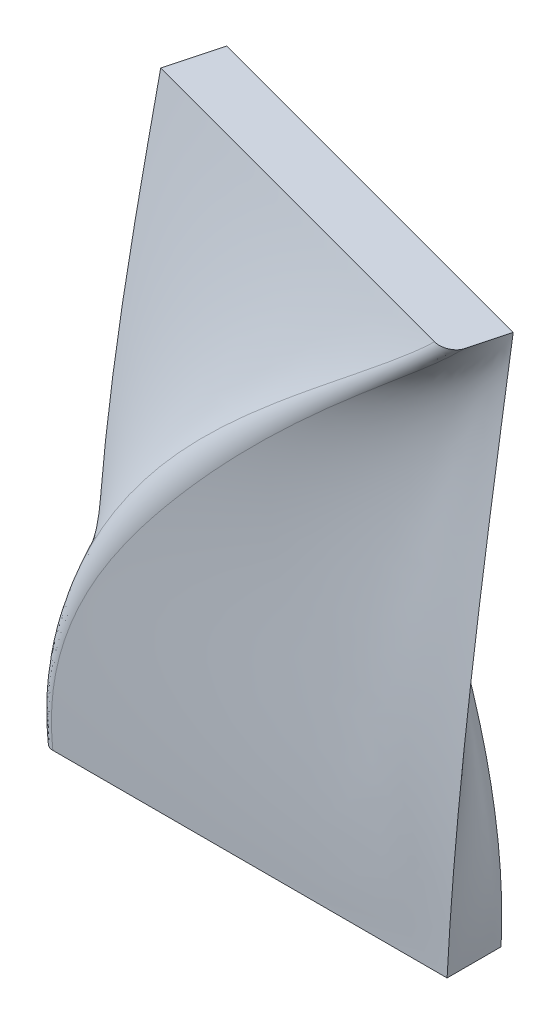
ISO-10303-21;
HEADER;
FILE_DESCRIPTION(('STEP AP214'),'2;1');
FILE_NAME('part.step','',(''),(''),'','','');
FILE_SCHEMA(('AUTOMOTIVE_DESIGN { 1 0 10303 214 1 1 1 1 }'));
ENDSEC;
DATA;
#1=APPLICATION_CONTEXT('core data for automotive mechanical design processes');
#2=APPLICATION_PROTOCOL_DEFINITION('international standard','automotive_design',2000,#1);
#3=PRODUCT_CONTEXT('',#1,'mechanical');
#4=PRODUCT('Part','Part','',(#3));
#5=PRODUCT_RELATED_PRODUCT_CATEGORY('part','',(#4));
#6=PRODUCT_DEFINITION_FORMATION('','',#4);
#7=PRODUCT_DEFINITION_CONTEXT('part definition',#1,'design');
#8=PRODUCT_DEFINITION('design','',#6,#7);
#9=PRODUCT_DEFINITION_SHAPE('','',#8);
#10=(LENGTH_UNIT() NAMED_UNIT(*) SI_UNIT(.MILLI.,.METRE.));
#11=(NAMED_UNIT(*) PLANE_ANGLE_UNIT() SI_UNIT($,.RADIAN.));
#12=(NAMED_UNIT(*) SI_UNIT($,.STERADIAN.) SOLID_ANGLE_UNIT());
#13=UNCERTAINTY_MEASURE_WITH_UNIT(LENGTH_MEASURE(1.E-05),#10,'distance_accuracy_value','');
#14=(GEOMETRIC_REPRESENTATION_CONTEXT(3) GLOBAL_UNCERTAINTY_ASSIGNED_CONTEXT((#13)) GLOBAL_UNIT_ASSIGNED_CONTEXT((#10,
#11,#12)) REPRESENTATION_CONTEXT('',''));
#15=CARTESIAN_POINT('',(0.,0.,0.));
#16=DIRECTION('',(0.,0.,1.));
#17=DIRECTION('',(1.,0.,0.));
#18=AXIS2_PLACEMENT_3D('',#15,#16,#17);
#19=CARTESIAN_POINT('',(75.,100.,0.));
#20=DIRECTION('',(0.,1.,0.));
#21=DIRECTION('',(0.,0.,1.));
#22=AXIS2_PLACEMENT_3D('',#19,#20,#21);
#23=PLANE('',#22);
#24=DIRECTION('',(0.96592582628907,0.,0.258819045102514));
#25=VECTOR('',#24,1.);
#26=CARTESIAN_POINT('',(75.,100.,0.));
#27=LINE('',#26,#25);
#28=CARTESIAN_POINT('',(2.55556302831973,100.,-19.4114283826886));
#29=VERTEX_POINT('',#28);
#30=CARTESIAN_POINT('',(71.818234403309,100.,-0.852551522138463));
#31=VERTEX_POINT('',#30);
#32=EDGE_CURVE('E155',#29,#31,#27,.T.);
#33=ORIENTED_EDGE('',*,*,#32,.T.);
#34=CARTESIAN_POINT('',(75.6619344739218,100.000051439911,-2.47620010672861));
#35=CARTESIAN_POINT('',(75.6575151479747,100.000051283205,-2.46031665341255));
#36=CARTESIAN_POINT('',(75.6528448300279,100.00003921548,-2.4445036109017));
#37=CARTESIAN_POINT('',(75.6429366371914,99.9999974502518,-2.4127598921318));
#38=CARTESIAN_POINT('',(75.6376904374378,99.9999674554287,-2.39683181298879));
#39=CARTESIAN_POINT('',(75.6266242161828,99.999895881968,-2.36487486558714));
#40=CARTESIAN_POINT('',(75.6207960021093,99.9998541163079,-2.34884883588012));
#41=CARTESIAN_POINT('',(75.608560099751,99.9997641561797,-2.31671396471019));
#42=CARTESIAN_POINT('',(75.6021443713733,99.9997158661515,-2.30060819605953));
#43=CARTESIAN_POINT('',(75.58185627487,99.999567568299,-2.25179959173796));
#44=CARTESIAN_POINT('',(75.5672221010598,99.9994664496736,-2.21941019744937));
#45=CARTESIAN_POINT('',(75.5356122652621,99.9992885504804,-2.15451241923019));
#46=CARTESIAN_POINT('',(75.5185766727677,99.9992126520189,-2.1220333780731));
#47=CARTESIAN_POINT('',(75.4821392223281,99.9991042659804,-2.05711250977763));
#48=CARTESIAN_POINT('',(75.4626807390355,99.9990731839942,-2.02470249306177));
#49=CARTESIAN_POINT('',(75.4213871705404,99.999062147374,-1.96008595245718));
#50=CARTESIAN_POINT('',(75.3994990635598,99.9990837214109,-1.92791337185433));
#51=CARTESIAN_POINT('',(75.3533491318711,99.9991731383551,-1.86394064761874));
#52=CARTESIAN_POINT('',(75.3290380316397,99.9992422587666,-1.83217610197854));
#53=CARTESIAN_POINT('',(75.278059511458,99.9994097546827,-1.76918918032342));
#54=CARTESIAN_POINT('',(75.251346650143,99.9995088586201,-1.73800362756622));
#55=CARTESIAN_POINT('',(75.1955959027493,99.9997036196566,-1.6763435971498));
#56=CARTESIAN_POINT('',(75.1665164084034,99.999799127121,-1.64590679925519));
#57=CARTESIAN_POINT('',(75.1060798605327,99.9999514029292,-1.58590266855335));
#58=CARTESIAN_POINT('',(75.0746850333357,100.000007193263,-1.55637337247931));
#59=CARTESIAN_POINT('',(75.0194763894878,99.9999948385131,-1.50710530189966));
#60=CARTESIAN_POINT('',(74.9960259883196,99.9999572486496,-1.48695702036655));
#61=CARTESIAN_POINT('',(74.9471383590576,99.9998405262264,-1.44645082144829));
#62=CARTESIAN_POINT('',(74.9216621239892,99.999759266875,-1.42613997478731));
#63=CARTESIAN_POINT('',(74.8686923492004,99.9995926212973,-1.38543759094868));
#64=CARTESIAN_POINT('',(74.8411619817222,99.9995072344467,-1.36509404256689));
#65=CARTESIAN_POINT('',(74.7840579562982,99.9993555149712,-1.32446690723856));
#66=CARTESIAN_POINT('',(74.7544494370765,99.9992902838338,-1.30423234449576));
#67=CARTESIAN_POINT('',(74.6931732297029,99.999196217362,-1.26397170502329));
#68=CARTESIAN_POINT('',(74.6614727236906,99.9991691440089,-1.24399560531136));
#69=CARTESIAN_POINT('',(74.5960066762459,99.9991588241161,-1.20440771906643));
#70=CARTESIAN_POINT('',(74.5622104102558,99.9991774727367,-1.18484676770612));
#71=CARTESIAN_POINT('',(74.4925584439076,99.9992555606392,-1.14625038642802));
#72=CARTESIAN_POINT('',(74.4566742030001,99.9993165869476,-1.12726649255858));
#73=CARTESIAN_POINT('',(74.3828641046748,99.9994654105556,-1.08998861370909));
#74=CARTESIAN_POINT('',(74.3449119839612,99.9995541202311,-1.07174665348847));
#75=CARTESIAN_POINT('',(74.2669971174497,99.9997296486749,-1.03611851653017));
#76=CARTESIAN_POINT('',(74.2270104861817,99.999816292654,-1.01878462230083));
#77=CARTESIAN_POINT('',(74.1450702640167,99.9999553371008,-0.985134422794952));
#78=CARTESIAN_POINT('',(74.1030952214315,100.000006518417,-0.968870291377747));
#79=CARTESIAN_POINT('',(74.0348717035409,99.9999959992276,-0.943963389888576));
#80=CARTESIAN_POINT('',(74.0088108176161,99.9999702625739,-0.934803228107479));
#81=CARTESIAN_POINT('',(73.9515396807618,99.9999120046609,-0.91542034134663));
#82=CARTESIAN_POINT('',(73.9202868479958,99.9998791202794,-0.905323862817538));
#83=CARTESIAN_POINT('',(73.8115051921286,99.9998227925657,-0.871805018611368));
#84=CARTESIAN_POINT('',(73.733294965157,99.9998838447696,-0.850542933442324));
#85=CARTESIAN_POINT('',(73.6078480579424,99.9999569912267,-0.820808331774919));
#86=CARTESIAN_POINT('',(73.5609982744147,99.9999788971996,-0.810657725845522));
#87=CARTESIAN_POINT('',(73.466337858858,100.000021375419,-0.792028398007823));
#88=CARTESIAN_POINT('',(73.4185226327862,100.00004192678,-0.783572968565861));
#89=CARTESIAN_POINT('',(73.2903431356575,100.000110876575,-0.763423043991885));
#90=CARTESIAN_POINT('',(73.2097138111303,100.00016870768,-0.753374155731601));
#91=CARTESIAN_POINT('',(73.0684048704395,100.000095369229,-0.740265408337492));
#92=CARTESIAN_POINT('',(73.0078258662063,100.000008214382,-0.73608174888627));
#93=CARTESIAN_POINT('',(72.9020371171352,99.9999938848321,-0.731277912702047));
#94=CARTESIAN_POINT('',(72.8568559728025,100.000031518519,-0.73002030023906));
#95=CARTESIAN_POINT('',(72.7681437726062,100.00012879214,-0.72911656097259));
#96=CARTESIAN_POINT('',(72.724613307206,100.000187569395,-0.729412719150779));
#97=CARTESIAN_POINT('',(72.6392303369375,100.000304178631,-0.731450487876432));
#98=CARTESIAN_POINT('',(72.5973765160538,100.000361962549,-0.733137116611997));
#99=CARTESIAN_POINT('',(72.5153632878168,100.000456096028,-0.737799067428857));
#100=CARTESIAN_POINT('',(72.4752009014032,100.000493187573,-0.740722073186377));
#101=CARTESIAN_POINT('',(72.3965766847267,100.000537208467,-0.747709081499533));
#102=CARTESIAN_POINT('',(72.3581104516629,100.000545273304,-0.751723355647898));
#103=CARTESIAN_POINT('',(72.282879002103,100.000532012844,-0.760755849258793));
#104=CARTESIAN_POINT('',(72.2461080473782,100.000511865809,-0.765726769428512));
#105=CARTESIAN_POINT('',(72.1405923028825,100.000412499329,-0.781610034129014));
#106=CARTESIAN_POINT('',(72.0720502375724,100.00029699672,-0.793912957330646));
#107=CARTESIAN_POINT('',(71.941642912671,100.000102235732,-0.821305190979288));
#108=CARTESIAN_POINT('',(71.8797083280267,100.00002072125,-0.836065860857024));
#109=CARTESIAN_POINT('',(71.8182344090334,100.,-0.852551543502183));
#110=B_SPLINE_CURVE_WITH_KNOTS('',3,(#34,#35,#36,#37,#38,#39,#40,#41,#42,#43,#44,#45,#46,#47,
#48,#49,#50,#51,#52,#53,#54,#55,#56,#57,#58,#59,#60,#61,#62,#63,#64,#65,#66,#67,#68,#69,#70,#71,
#72,#73,#74,#75,#76,#77,#78,#79,#80,#81,#82,#83,#84,#85,#86,#87,#88,#89,#90,#91,#92,#93,#94,#95,
#96,#97,#98,#99,#100,#101,#102,#103,#104,#105,#106,#107,#108,#109),.UNSPECIFIED.,.F.,.F.,(4,2,2,
2,2,2,2,2,2,2,2,2,2,2,2,2,2,2,2,2,2,2,2,2,2,2,2,2,2,2,2,2,2,2,2,2,2,4),(0.,0.0494575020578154,
0.0997589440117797,0.150909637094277,0.202912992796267,0.309470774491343,0.419437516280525,
0.532783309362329,0.64945860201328,0.769397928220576,0.892523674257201,1.0187498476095,
1.14798580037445,1.24071835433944,1.33844139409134,1.44111261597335,1.54867491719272,
1.66105735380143,1.77817612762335,1.89993566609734,2.02622983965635,2.15694334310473,
2.29195324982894,2.37481753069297,2.47333835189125,2.71627328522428,2.86005441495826,
3.00569299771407,3.2492709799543,3.43137732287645,3.56694575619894,3.6975149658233,
3.82315572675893,3.9439414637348,4.05994750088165,4.17125048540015,4.38003654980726,
4.5709514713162),.UNSPECIFIED.);
#111=CARTESIAN_POINT('',(75.6634721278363,100.,-2.47611169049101));
#112=VERTEX_POINT('',#111);
#113=EDGE_CURVE('E117',#31,#112,#110,.F.);
#114=ORIENTED_EDGE('',*,*,#113,.T.);
#115=DIRECTION('',(0.258819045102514,0.,-0.96592582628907));
#116=VECTOR('',#115,1.);
#117=CARTESIAN_POINT('',(75.,100.,0.));
#118=LINE('',#117,#116);
#119=CARTESIAN_POINT('',(77.5881904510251,100.,-9.65925826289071));
#120=VERTEX_POINT('',#119);
#121=EDGE_CURVE('E220',#112,#120,#118,.T.);
#122=ORIENTED_EDGE('',*,*,#121,.T.);
#123=DIRECTION('',(-0.96592582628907,0.,-0.258819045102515));
#124=VECTOR('',#123,1.);
#125=CARTESIAN_POINT('',(77.5881904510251,100.,-9.65925826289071));
#126=LINE('',#125,#124);
#127=CARTESIAN_POINT('',(5.14375347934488,100.,-29.0706866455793));
#128=VERTEX_POINT('',#127);
#129=EDGE_CURVE('E170',#120,#128,#126,.T.);
#130=ORIENTED_EDGE('',*,*,#129,.T.);
#131=DIRECTION('',(-0.258819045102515,0.,0.96592582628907));
#132=VECTOR('',#131,1.);
#133=CARTESIAN_POINT('',(2.55556302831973,100.,-19.4114283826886));
#134=LINE('',#133,#132);
#135=EDGE_CURVE('E145',#128,#29,#134,.T.);
#136=ORIENTED_EDGE('',*,*,#135,.T.);
#137=EDGE_LOOP('',(#33,#114,#122,#130,#136));
#138=FACE_BOUND('',#137,.T.);
#139=ADVANCED_FACE('F91',(#138),#23,.T.);
#140=CARTESIAN_POINT('',(0.,0.,-10.));
#141=DIRECTION('',(0.,-1.,0.));
#142=DIRECTION('',(0.,0.,-1.));
#143=AXIS2_PLACEMENT_3D('',#140,#141,#142);
#144=PLANE('',#143);
#145=DIRECTION('',(1.,0.,0.));
#146=VECTOR('',#145,1.);
#147=CARTESIAN_POINT('',(0.,0.,0.));
#148=LINE('',#147,#146);
#149=CARTESIAN_POINT('',(1.99710814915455,0.,0.));
#150=VERTEX_POINT('',#149);
#151=CARTESIAN_POINT('',(75.,0.,0.));
#152=VERTEX_POINT('',#151);
#153=EDGE_CURVE('E303',#150,#152,#148,.T.);
#154=ORIENTED_EDGE('',*,*,#153,.F.);
#155=CARTESIAN_POINT('',(-0.000113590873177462,-2.02841709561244E-08,-1.99691704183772));
#156=CARTESIAN_POINT('',(-0.000113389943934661,-2.15228824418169E-07,-1.96255467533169));
#157=CARTESIAN_POINT('',(0.000773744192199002,-1.23046115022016E-05,-1.92819238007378));
#158=CARTESIAN_POINT('',(0.00431919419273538,-5.2598160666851E-05,-1.8595011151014));
#159=CARTESIAN_POINT('',(0.0069804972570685,-8.0829494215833E-05,-1.82517229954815));
#160=CARTESIAN_POINT('',(0.0140711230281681,-0.000145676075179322,-1.75670208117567));
#161=CARTESIAN_POINT('',(0.0185002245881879,-0.000182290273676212,-1.72256065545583));
#162=CARTESIAN_POINT('',(0.0291043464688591,-0.000257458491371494,-1.65461841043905));
#163=CARTESIAN_POINT('',(0.0352759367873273,-0.000296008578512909,-1.62081705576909));
#164=CARTESIAN_POINT('',(0.0493258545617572,-0.000369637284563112,-1.55370481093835));
#165=CARTESIAN_POINT('',(0.0571976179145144,-0.0004047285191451,-1.52039254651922));
#166=CARTESIAN_POINT('',(0.0745918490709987,-0.000467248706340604,-1.45440255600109));
#167=CARTESIAN_POINT('',(0.0841047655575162,-0.000494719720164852,-1.42172231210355));
#168=CARTESIAN_POINT('',(0.10470959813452,-0.000539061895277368,-1.3571323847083));
#169=CARTESIAN_POINT('',(0.115789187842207,-0.000556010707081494,-1.32521876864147));
#170=CARTESIAN_POINT('',(0.139441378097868,-0.000577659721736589,-1.2622880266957));
#171=CARTESIAN_POINT('',(0.151999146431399,-0.000582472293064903,-1.23126532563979));
#172=CARTESIAN_POINT('',(0.178509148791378,-0.000579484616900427,-1.17023050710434));
#173=CARTESIAN_POINT('',(0.192444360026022,-0.000571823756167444,-1.14021099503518));
#174=CARTESIAN_POINT('',(0.221600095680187,-0.000544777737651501,-1.08128340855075));
#175=CARTESIAN_POINT('',(0.236801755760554,-0.000525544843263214,-1.05236599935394));
#176=CARTESIAN_POINT('',(0.268372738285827,-0.000477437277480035,-0.995729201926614));
#177=CARTESIAN_POINT('',(0.284721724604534,-0.000448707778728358,-0.967998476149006));
#178=CARTESIAN_POINT('',(0.318463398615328,-0.000384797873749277,-0.913806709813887));
#179=CARTESIAN_POINT('',(0.335834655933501,-0.000349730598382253,-0.887332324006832));
#180=CARTESIAN_POINT('',(0.371492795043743,-0.000277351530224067,-0.835709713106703));
#181=CARTESIAN_POINT('',(0.389757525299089,-0.000240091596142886,-0.810546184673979));
#182=CARTESIAN_POINT('',(0.42707254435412,-0.000168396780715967,-0.761586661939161));
#183=CARTESIAN_POINT('',(0.44610031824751,-0.000133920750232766,-0.73777350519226));
#184=CARTESIAN_POINT('',(0.484811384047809,-7.3726859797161E-05,-0.69154141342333));
#185=CARTESIAN_POINT('',(0.504472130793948,-4.78383414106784E-05,-0.66910359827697));
#186=CARTESIAN_POINT('',(0.544320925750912,-1.10231079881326E-05,-0.625634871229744));
#187=CARTESIAN_POINT('',(0.56448670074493,2.31571461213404E-07,-0.604583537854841));
#188=CARTESIAN_POINT('',(0.605524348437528,-2.29344670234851E-07,-0.563584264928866));
#189=CARTESIAN_POINT('',(0.62638756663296,-1.17250989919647E-05,-0.543627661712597));
#190=CARTESIAN_POINT('',(0.66948799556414,-5.02043929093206E-05,-0.50415729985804));
#191=CARTESIAN_POINT('',(0.691746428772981,-7.75640465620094E-05,-0.484666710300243));
#192=CARTESIAN_POINT('',(0.737631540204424,-0.000141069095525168,-0.44625736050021));
#193=CARTESIAN_POINT('',(0.761277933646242,-0.000177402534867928,-0.427362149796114));
#194=CARTESIAN_POINT('',(0.809919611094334,-0.000253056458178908,-0.390275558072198));
#195=CARTESIAN_POINT('',(0.834932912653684,-0.00029242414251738,-0.372107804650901));
#196=CARTESIAN_POINT('',(0.886274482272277,-0.000368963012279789,-0.336609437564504));
#197=CARTESIAN_POINT('',(0.912618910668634,-0.000406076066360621,-0.319302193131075));
#198=CARTESIAN_POINT('',(0.966573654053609,-0.000473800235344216,-0.285657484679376));
#199=CARTESIAN_POINT('',(0.994198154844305,-0.000504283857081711,-0.269342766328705));
#200=CARTESIAN_POINT('',(1.05064849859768,-0.00055542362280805,-0.237812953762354));
#201=CARTESIAN_POINT('',(1.07948648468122,-0.000575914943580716,-0.222619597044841));
#202=CARTESIAN_POINT('',(1.13828384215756,-0.000604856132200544,-0.19345731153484));
#203=CARTESIAN_POINT('',(1.1682533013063,-0.000613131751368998,-0.179508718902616));
#204=CARTESIAN_POINT('',(1.22921866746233,-0.000616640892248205,-0.152953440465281));
#205=CARTESIAN_POINT('',(1.26022265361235,-0.000611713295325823,-0.140365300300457));
#206=CARTESIAN_POINT('',(1.32314798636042,-0.000589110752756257,-0.116638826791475));
#207=CARTESIAN_POINT('',(1.35507551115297,-0.000571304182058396,-0.105516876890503));
#208=CARTESIAN_POINT('',(1.41972591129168,-0.000524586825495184,-0.0848189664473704));
#209=CARTESIAN_POINT('',(1.45245323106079,-0.000495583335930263,-0.0752568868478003));
#210=CARTESIAN_POINT('',(1.51856989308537,-0.000429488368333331,-0.0577612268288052));
#211=CARTESIAN_POINT('',(1.5519621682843,-0.000392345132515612,-0.0498387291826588));
#212=CARTESIAN_POINT('',(1.61926603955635,-0.000314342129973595,-0.035689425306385));
#213=CARTESIAN_POINT('',(1.65317932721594,-0.000273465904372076,-0.0294706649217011));
#214=CARTESIAN_POINT('',(1.7213753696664,-0.000193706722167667,-0.0187792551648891));
#215=CARTESIAN_POINT('',(1.7556588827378,-0.000154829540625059,-0.014311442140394));
#216=CARTESIAN_POINT('',(1.82444082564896,-8.59351831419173E-05,-0.00715507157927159));
#217=CARTESIAN_POINT('',(1.85893941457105,-5.59256332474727E-05,-0.00446804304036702));
#218=CARTESIAN_POINT('',(1.92799476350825,-1.30692217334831E-05,-0.000886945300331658));
#219=CARTESIAN_POINT('',(1.96255143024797,-2.05146081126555E-07,8.92267631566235E-06));
#220=CARTESIAN_POINT('',(1.9971081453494,-2.11112126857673E-10,8.12899409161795E-06));
#221=B_SPLINE_CURVE_WITH_KNOTS('',3,(#155,#156,#157,#158,#159,#160,#161,#162,#163,#164,#165,
#166,#167,#168,#169,#170,#171,#172,#173,#174,#175,#176,#177,#178,#179,#180,#181,#182,#183,#184,
#185,#186,#187,#188,#189,#190,#191,#192,#193,#194,#195,#196,#197,#198,#199,#200,#201,#202,#203,
#204,#205,#206,#207,#208,#209,#210,#211,#212,#213,#214,#215,#216,#217,#218,#219,#220),
.UNSPECIFIED.,.F.,.F.,(4,2,2,2,2,2,2,2,2,2,2,2,2,2,2,2,2,2,2,2,2,2,2,2,2,2,2,2,2,2,2,2,4),(0.,
0.103075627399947,0.206325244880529,0.309561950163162,0.412596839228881,0.515240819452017,
0.617306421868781,0.718609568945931,0.818971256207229,0.918219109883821,1.01618878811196,
1.11272519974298,1.20768352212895,1.3009300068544,1.39234256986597,1.4818111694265,
1.56923798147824,1.65582409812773,1.74455225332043,1.83532640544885,1.92803786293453,
2.02256538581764,2.11877549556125,2.21652300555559,2.31565177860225,2.41599571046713,
2.5173799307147,2.61962220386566,2.72253450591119,2.82592474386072,2.92959857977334,
3.03336131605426,3.13701979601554),.UNSPECIFIED.);
#222=CARTESIAN_POINT('',(0.,0.,-1.99691742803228));
#223=VERTEX_POINT('',#222);
#224=EDGE_CURVE('E13',#150,#223,#221,.F.);
#225=ORIENTED_EDGE('',*,*,#224,.T.);
#226=DIRECTION('',(0.,0.,1.));
#227=VECTOR('',#226,1.);
#228=CARTESIAN_POINT('',(0.,0.,0.));
#229=LINE('',#228,#227);
#230=CARTESIAN_POINT('',(0.,0.,-10.));
#231=VERTEX_POINT('',#230);
#232=EDGE_CURVE('E96',#231,#223,#229,.T.);
#233=ORIENTED_EDGE('',*,*,#232,.F.);
#234=DIRECTION('',(-1.,0.,0.));
#235=VECTOR('',#234,1.);
#236=CARTESIAN_POINT('',(0.,0.,-10.));
#237=LINE('',#236,#235);
#238=CARTESIAN_POINT('',(75.,0.,-10.));
#239=VERTEX_POINT('',#238);
#240=EDGE_CURVE('E149',#239,#231,#237,.T.);
#241=ORIENTED_EDGE('',*,*,#240,.F.);
#242=DIRECTION('',(0.,0.,-1.));
#243=VECTOR('',#242,1.);
#244=CARTESIAN_POINT('',(75.,0.,0.));
#245=LINE('',#244,#243);
#246=EDGE_CURVE('E293',#152,#239,#245,.T.);
#247=ORIENTED_EDGE('',*,*,#246,.F.);
#248=EDGE_LOOP('',(#154,#225,#233,#241,#247));
#249=FACE_BOUND('',#248,.T.);
#250=ADVANCED_FACE('F93',(#249),#144,.T.);
#251=CARTESIAN_POINT('',(75.,0.,0.));
#252=CARTESIAN_POINT('',(76.7532328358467,33.4536753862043,0.));
#253=CARTESIAN_POINT('',(77.1707116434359,66.7268376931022,-4.82962913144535));
#254=CARTESIAN_POINT('',(77.5881904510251,100.,-9.65925826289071));
#255=CARTESIAN_POINT('',(75.,0.,-0.833333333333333));
#256=CARTESIAN_POINT('',(76.7598825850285,33.5338041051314,-0.830882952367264));
#257=CARTESIAN_POINT('',(74.1555183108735,66.7669020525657,-6.05388012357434));
#258=CARTESIAN_POINT('',(71.5511540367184,100.,-11.2768772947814));
#259=CARTESIAN_POINT('',(75.,0.,-2.5));
#260=CARTESIAN_POINT('',(76.7731820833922,33.6940615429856,-2.49264885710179));
#261=CARTESIAN_POINT('',(68.1251316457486,66.8470307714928,-8.50238210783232));
#262=CARTESIAN_POINT('',(59.4770812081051,100.,-14.5121153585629));
#263=CARTESIAN_POINT('',(75.,0.,-4.58333333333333));
#264=CARTESIAN_POINT('',(76.8129886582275,35.0380669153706,-4.60661195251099));
#265=CARTESIAN_POINT('',(60.5987394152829,67.5190334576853,-11.5813874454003));
#266=CARTESIAN_POINT('',(44.3844901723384,100.,-18.5561629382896));
#267=CARTESIAN_POINT('',(75.,0.,-6.25));
#268=CARTESIAN_POINT('',(76.9546207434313,36.5249106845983,-6.20956871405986));
#269=CARTESIAN_POINT('',(54.6325190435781,68.2624553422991,-14.0004848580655));
#270=CARTESIAN_POINT('',(32.310417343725,100.,-21.7914010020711));
#271=CARTESIAN_POINT('',(75.,0.,-7.5));
#272=CARTESIAN_POINT('',(76.829859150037,37.8614239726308,-7.65437400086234));
#273=CARTESIAN_POINT('',(50.042360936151,68.9307119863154,-15.9361017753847));
#274=CARTESIAN_POINT('',(23.2548627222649,100.,-24.2178295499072));
#275=CARTESIAN_POINT('',(75.,0.,-8.75));
#276=CARTESIAN_POINT('',(77.6406435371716,39.3754295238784,-8.17293528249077));
#277=CARTESIAN_POINT('',(45.9199758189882,69.6877147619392,-17.408596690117));
#278=CARTESIAN_POINT('',(14.1993081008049,100.,-26.6442580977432));
#279=CARTESIAN_POINT('',(75.,0.,-9.58333333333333));
#280=CARTESIAN_POINT('',(75.8802145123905,40.5241909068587,-10.8269016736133));
#281=CARTESIAN_POINT('',(42.0212430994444,70.2620954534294,-19.5443894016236));
#282=CARTESIAN_POINT('',(8.16227168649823,100.,-28.2618771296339));
#283=CARTESIAN_POINT('',(75.,0.,-10.));
#284=CARTESIAN_POINT('',(75.,41.0985715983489,-12.1538848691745));
#285=CARTESIAN_POINT('',(40.0718767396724,70.5492857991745,-20.6122857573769));
#286=CARTESIAN_POINT('',(5.14375347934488,100.,-29.0706866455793));
#287=B_SPLINE_SURFACE_WITH_KNOTS('',3,3,((#251,#252,#253,#254),(#255,#256,#257,#258),(#259,#260,
#261,#262),(#263,#264,#265,#266),(#267,#268,#269,#270),(#271,#272,#273,#274),(#275,#276,#277,
#278),(#279,#280,#281,#282),(#283,#284,#285,#286)),.UNSPECIFIED.,.F.,.F.,.F.,(4,1,1,1,1,1,4),(4,
4),(0.,0.25,0.5,0.625,0.75,0.875,1.),(0.,1.),.UNSPECIFIED.);
#288=CARTESIAN_POINT('',(75.,0.,-10.));
#289=CARTESIAN_POINT('',(75.,41.0985715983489,-12.1538848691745));
#290=CARTESIAN_POINT('',(40.0718767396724,70.5492857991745,-20.6122857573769));
#291=CARTESIAN_POINT('',(5.14375347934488,100.,-29.0706866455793));
#292=B_SPLINE_CURVE_WITH_KNOTS('',3,(#288,#289,#290,#291),.UNSPECIFIED.,.F.,.F.,(4,4),(0.,1.),.UNSPECIFIED.);
#293=EDGE_CURVE('E334',#239,#128,#292,.T.);
#294=CARTESIAN_POINT('',(75.,0.,0.));
#295=CARTESIAN_POINT('',(76.7532328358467,33.4536753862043,0.));
#296=CARTESIAN_POINT('',(77.1707116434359,66.7268376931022,-4.82962913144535));
#297=CARTESIAN_POINT('',(77.5881904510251,100.,-9.65925826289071));
#298=B_SPLINE_CURVE_WITH_KNOTS('',3,(#294,#295,#296,#297),.UNSPECIFIED.,.F.,.F.,(4,4),(0.,1.),.UNSPECIFIED.);
#299=EDGE_CURVE('E154',#120,#152,#298,.F.);
#300=ORIENTED_EDGE('',*,*,#246,.T.);
#301=ORIENTED_EDGE('',*,*,#293,.T.);
#302=ORIENTED_EDGE('',*,*,#129,.F.);
#303=ORIENTED_EDGE('',*,*,#299,.T.);
#304=EDGE_LOOP('',(#300,#301,#302,#303));
#305=FACE_BOUND('',#304,.T.);
#306=ADVANCED_FACE('F333',(#305),#287,.T.);
#307=CARTESIAN_POINT('',(75.,0.,-10.));
#308=CARTESIAN_POINT('',(75.,41.0985715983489,-12.1538848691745));
#309=CARTESIAN_POINT('',(40.0718767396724,70.5492857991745,-20.6122857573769));
#310=CARTESIAN_POINT('',(5.14375347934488,100.,-29.0706866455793));
#311=CARTESIAN_POINT('',(68.75,0.,-10.));
#312=CARTESIAN_POINT('',(68.7519940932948,39.9775012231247,-12.0971261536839));
#313=CARTESIAN_POINT('',(36.8400325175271,69.9887506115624,-20.1814373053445));
#314=CARTESIAN_POINT('',(4.92807094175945,100.,-28.2657484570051));
#315=CARTESIAN_POINT('',(56.25,0.,-10.));
#316=CARTESIAN_POINT('',(56.2559822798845,37.7353604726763,-11.9836087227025));
#317=CARTESIAN_POINT('',(30.3763440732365,68.8676802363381,-19.3197404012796));
#318=CARTESIAN_POINT('',(4.49670586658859,100.,-26.6558720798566));
#319=CARTESIAN_POINT('',(40.625,0.,-10.));
#320=CARTESIAN_POINT('',(40.6060561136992,35.7019669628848,-11.8521169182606));
#321=CARTESIAN_POINT('',(22.2817778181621,67.8509834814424,-18.2478217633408));
#322=CARTESIAN_POINT('',(3.95749952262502,100.,-24.6435266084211));
#323=CARTESIAN_POINT('',(28.125,0.,-10.));
#324=CARTESIAN_POINT('',(28.1579025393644,34.5101550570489,-11.8415031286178));
#325=CARTESIAN_POINT('',(15.8420184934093,67.2550775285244,-17.4375766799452));
#326=CARTESIAN_POINT('',(3.52613444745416,100.,-23.0336502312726));
#327=CARTESIAN_POINT('',(18.75,0.,-10.));
#328=CARTESIAN_POINT('',(18.6243721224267,33.8760544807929,-11.6497409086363));
#329=CARTESIAN_POINT('',(10.9134913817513,66.9380272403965,-16.7379919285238));
#330=CARTESIAN_POINT('',(3.20261064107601,100.,-21.8262429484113));
#331=CARTESIAN_POINT('',(9.375,0.,-10.));
#332=CARTESIAN_POINT('',(9.84460897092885,33.4864441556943,-12.2245591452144));
#333=CARTESIAN_POINT('',(6.36184790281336,66.7432220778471,-16.4216974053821));
#334=CARTESIAN_POINT('',(2.87908683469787,100.,-20.6188356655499));
#335=CARTESIAN_POINT('',(3.125,0.,-10.));
#336=CARTESIAN_POINT('',(2.11299765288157,33.4591941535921,-10.7415197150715));
#337=CARTESIAN_POINT('',(2.38820097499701,66.7295970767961,-15.2777085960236));
#338=CARTESIAN_POINT('',(2.66340429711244,100.,-19.8138974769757));
#339=CARTESIAN_POINT('',(0.,0.,-10.));
#340=CARTESIAN_POINT('',(-1.75280800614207,33.445569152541,-10.));
#341=CARTESIAN_POINT('',(0.40137751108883,66.7227845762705,-14.7057141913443));
#342=CARTESIAN_POINT('',(2.55556302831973,100.,-19.4114283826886));
#343=B_SPLINE_SURFACE_WITH_KNOTS('',3,3,((#307,#308,#309,#310),(#311,#312,#313,#314),(#315,#316,
#317,#318),(#319,#320,#321,#322),(#323,#324,#325,#326),(#327,#328,#329,#330),(#331,#332,#333,
#334),(#335,#336,#337,#338),(#339,#340,#341,#342)),.UNSPECIFIED.,.F.,.F.,.F.,(4,1,1,1,1,1,4),(4,
4),(0.,0.25,0.5,0.625,0.75,0.875,1.),(0.,1.),.UNSPECIFIED.);
#344=CARTESIAN_POINT('',(0.,0.,-10.));
#345=CARTESIAN_POINT('',(-1.75280800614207,33.445569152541,-10.));
#346=CARTESIAN_POINT('',(0.40137751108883,66.7227845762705,-14.7057141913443));
#347=CARTESIAN_POINT('',(2.55556302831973,100.,-19.4114283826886));
#348=B_SPLINE_CURVE_WITH_KNOTS('',3,(#344,#345,#346,#347),.UNSPECIFIED.,.F.,.F.,(4,4),(0.,1.),.UNSPECIFIED.);
#349=EDGE_CURVE('E140',#231,#29,#348,.T.);
#350=ORIENTED_EDGE('',*,*,#240,.T.);
#351=ORIENTED_EDGE('',*,*,#349,.T.);
#352=ORIENTED_EDGE('',*,*,#135,.F.);
#353=ORIENTED_EDGE('',*,*,#293,.F.);
#354=EDGE_LOOP('',(#350,#351,#352,#353));
#355=FACE_BOUND('',#354,.T.);
#356=ADVANCED_FACE('F142',(#355),#343,.T.);
#357=CARTESIAN_POINT('',(0.,0.,0.));
#358=CARTESIAN_POINT('',(0.,41.6095639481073,2.180664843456));
#359=CARTESIAN_POINT('',(37.5,70.8047819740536,1.090332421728));
#360=CARTESIAN_POINT('',(75.,100.,0.));
#361=CARTESIAN_POINT('',(6.25,0.,0.));
#362=CARTESIAN_POINT('',(6.24800542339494,40.4591176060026,2.12236708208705));
#363=CARTESIAN_POINT('',(40.7318439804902,70.2295588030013,0.658714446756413));
#364=CARTESIAN_POINT('',(75.2156825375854,100.,-0.804938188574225));
#365=CARTESIAN_POINT('',(18.75,0.,0.));
#366=CARTESIAN_POINT('',(18.7440162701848,38.1582249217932,2.00577155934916));
#367=CARTESIAN_POINT('',(47.1955319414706,69.0791124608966,-0.204521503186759));
#368=CARTESIAN_POINT('',(75.6470476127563,100.,-2.41481456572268));
#369=CARTESIAN_POINT('',(34.375,0.,0.));
#370=CARTESIAN_POINT('',(34.393948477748,36.0259522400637,1.86909167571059));
#371=CARTESIAN_POINT('',(55.2901012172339,68.0129761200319,-1.27903418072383));
#372=CARTESIAN_POINT('',(76.1862539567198,100.,-4.42716003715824));
#373=CARTESIAN_POINT('',(46.875,0.,0.));
#374=CARTESIAN_POINT('',(46.8420894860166,34.7444487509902,1.8537899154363));
#375=CARTESIAN_POINT('',(61.7298542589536,67.3722243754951,-2.09162324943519));
#376=CARTESIAN_POINT('',(76.6176190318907,100.,-6.03703641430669));
#377=CARTESIAN_POINT('',(56.25,0.,0.));
#378=CARTESIAN_POINT('',(56.3756583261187,34.0380296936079,1.6581992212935));
#379=CARTESIAN_POINT('',(66.6584005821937,67.019014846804,-2.79312223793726));
#380=CARTESIAN_POINT('',(76.9411428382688,100.,-7.24444369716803));
#381=CARTESIAN_POINT('',(65.625,0.,0.));
#382=CARTESIAN_POINT('',(65.1552772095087,33.5724856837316,2.22918221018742));
#383=CARTESIAN_POINT('',(71.2099719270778,66.7862428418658,-3.11133438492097));
#384=CARTESIAN_POINT('',(77.264666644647,100.,-8.45185098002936));
#385=CARTESIAN_POINT('',(71.875,0.,0.));
#386=CARTESIAN_POINT('',(72.8872476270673,33.4932788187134,0.743060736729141));
#387=CARTESIAN_POINT('',(75.1837984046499,66.7466394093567,-4.25686421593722));
#388=CARTESIAN_POINT('',(77.4803491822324,100.,-9.25678916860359));
#389=CARTESIAN_POINT('',(75.,0.,0.));
#390=CARTESIAN_POINT('',(76.7532328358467,33.4536753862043,0.));
#391=CARTESIAN_POINT('',(77.1707116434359,66.7268376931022,-4.82962913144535));
#392=CARTESIAN_POINT('',(77.5881904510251,100.,-9.6592582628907));
#393=B_SPLINE_SURFACE_WITH_KNOTS('',3,3,((#357,#358,#359,#360),(#361,#362,#363,#364),(#365,#366,
#367,#368),(#369,#370,#371,#372),(#373,#374,#375,#376),(#377,#378,#379,#380),(#381,#382,#383,
#384),(#385,#386,#387,#388),(#389,#390,#391,#392)),.UNSPECIFIED.,.F.,.F.,.F.,(4,1,1,1,1,1,4),(4,
4),(0.,0.25,0.5,0.625,0.75,0.875,1.),(0.,1.),.UNSPECIFIED.);
#394=CARTESIAN_POINT('',(75.663355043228,99.9998596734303,-2.47614304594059));
#395=CARTESIAN_POINT('',(75.3420410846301,99.6701926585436,-2.3771168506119));
#396=CARTESIAN_POINT('',(75.0150490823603,99.344912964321,-2.28218992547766));
#397=CARTESIAN_POINT('',(74.3667360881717,98.7164301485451,-2.10483680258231));
#398=CARTESIAN_POINT('',(74.0458374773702,98.4128970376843,-2.02203779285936));
#399=CARTESIAN_POINT('',(73.4892922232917,97.8968923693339,-1.88663311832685));
#400=CARTESIAN_POINT('',(73.255349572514,97.6830688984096,-1.83213653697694));
#401=CARTESIAN_POINT('',(72.7949611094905,97.2670408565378,-1.7297214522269));
#402=CARTESIAN_POINT('',(72.5686422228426,97.0647411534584,-1.68161849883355));
#403=CARTESIAN_POINT('',(71.950451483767,96.5170299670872,-1.55584684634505));
#404=CARTESIAN_POINT('',(71.5564425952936,96.1732074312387,-1.4817623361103));
#405=CARTESIAN_POINT('',(70.7516924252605,95.4790213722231,-1.34030496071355));
#406=CARTESIAN_POINT('',(70.3408049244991,95.1287733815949,-1.27320195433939));
#407=CARTESIAN_POINT('',(69.5900721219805,94.4936967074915,-1.15875928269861));
#408=CARTESIAN_POINT('',(69.2507789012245,94.2084618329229,-1.11003789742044));
#409=CARTESIAN_POINT('',(68.6260404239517,93.6852368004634,-1.02523372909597));
#410=CARTESIAN_POINT('',(68.3408137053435,93.4471089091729,-0.988384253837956));
#411=CARTESIAN_POINT('',(67.442585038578,92.6988036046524,-0.877362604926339));
#412=CARTESIAN_POINT('',(66.8282749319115,92.1893673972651,-0.808774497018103));
#413=CARTESIAN_POINT('',(65.5438992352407,91.1254971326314,-0.676600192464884));
#414=CARTESIAN_POINT('',(64.8737212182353,90.5710797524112,-0.613997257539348));
#415=CARTESIAN_POINT('',(63.4810365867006,89.4165482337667,-0.49385107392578));
#416=CARTESIAN_POINT('',(62.7585832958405,88.8162878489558,-0.43709955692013));
#417=CARTESIAN_POINT('',(61.4607881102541,87.7322876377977,-0.342653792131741));
#418=CARTESIAN_POINT('',(60.884947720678,87.2492764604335,-0.303418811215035));
#419=CARTESIAN_POINT('',(59.6804066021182,86.234345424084,-0.225452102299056));
#420=CARTESIAN_POINT('',(59.0519058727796,85.7021572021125,-0.187125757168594));
#421=CARTESIAN_POINT('',(57.7440722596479,84.5883350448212,-0.111121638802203));
#422=CARTESIAN_POINT('',(57.0649994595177,84.0063725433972,-0.0737809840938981));
#423=CARTESIAN_POINT('',(56.0297566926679,83.1127220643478,-0.0193650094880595));
#424=CARTESIAN_POINT('',(55.6721165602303,82.8028123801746,-0.00102703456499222));
#425=CARTESIAN_POINT('',(55.0418116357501,82.2543838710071,0.0305706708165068));
#426=CARTESIAN_POINT('',(54.768890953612,82.0161695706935,0.0440126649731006));
#427=CARTESIAN_POINT('',(53.9112612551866,81.2652793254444,0.0856001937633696));
#428=CARTESIAN_POINT('',(53.3278505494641,80.7510738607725,0.112933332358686));
#429=CARTESIAN_POINT('',(52.1121483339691,79.6722096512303,0.168311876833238));
#430=CARTESIAN_POINT('',(51.4801831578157,79.1071751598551,0.196199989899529));
#431=CARTESIAN_POINT('',(50.1695376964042,77.9260467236,0.252513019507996));
#432=CARTESIAN_POINT('',(49.4912303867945,77.3095318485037,0.280797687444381));
#433=CARTESIAN_POINT('',(48.3054456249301,76.2217255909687,0.328964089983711));
#434=CARTESIAN_POINT('',(47.7967474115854,75.7517803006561,0.349209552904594));
#435=CARTESIAN_POINT('',(46.7094812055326,74.7404325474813,0.391747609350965));
#436=CARTESIAN_POINT('',(46.1314087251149,74.1984920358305,0.413914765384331));
#437=CARTESIAN_POINT('',(44.9080008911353,73.0423750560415,0.459996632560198));
#438=CARTESIAN_POINT('',(44.2632342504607,72.4275912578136,0.483786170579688));
#439=CARTESIAN_POINT('',(43.2742424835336,71.4755490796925,0.519553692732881));
#440=CARTESIAN_POINT('',(42.9279407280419,71.1404611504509,0.531940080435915));
#441=CARTESIAN_POINT('',(42.2935634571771,70.5234867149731,0.554395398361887));
#442=CARTESIAN_POINT('',(42.005231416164,70.2418656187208,0.564511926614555));
#443=CARTESIAN_POINT('',(41.1439300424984,69.3970552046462,0.594476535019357));
#444=CARTESIAN_POINT('',(40.5727232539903,68.8320552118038,0.61400913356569));
#445=CARTESIAN_POINT('',(39.4380896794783,67.6995079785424,0.652097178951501));
#446=CARTESIAN_POINT('',(38.874639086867,67.131984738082,0.670656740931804));
#447=CARTESIAN_POINT('',(37.7561949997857,65.9940639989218,0.706734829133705));
#448=CARTESIAN_POINT('',(37.2011736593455,65.4236940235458,0.724257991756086));
#449=CARTESIAN_POINT('',(36.0556560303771,64.2352469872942,0.759695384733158));
#450=CARTESIAN_POINT('',(35.4655773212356,63.6167656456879,0.777542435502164));
#451=CARTESIAN_POINT('',(34.3105005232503,62.3947007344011,0.811706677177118));
#452=CARTESIAN_POINT('',(33.7453151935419,61.7912949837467,0.828054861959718));
#453=CARTESIAN_POINT('',(32.6396684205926,60.5993279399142,0.85921950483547));
#454=CARTESIAN_POINT('',(32.0990133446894,60.0109471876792,0.874068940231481));
#455=CARTESIAN_POINT('',(31.0417638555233,58.8492464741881,0.902284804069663));
#456=CARTESIAN_POINT('',(30.5249793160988,58.2761003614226,0.915684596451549));
#457=CARTESIAN_POINT('',(29.5148445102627,57.1450279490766,0.941045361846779));
#458=CARTESIAN_POINT('',(29.021306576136,56.5872700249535,0.953040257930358));
#459=CARTESIAN_POINT('',(28.0569632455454,55.4871837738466,0.975646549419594));
#460=CARTESIAN_POINT('',(27.5859755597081,54.9450159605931,0.986292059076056));
#461=CARTESIAN_POINT('',(26.6661018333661,53.8762465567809,1.0062522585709));
#462=CARTESIAN_POINT('',(26.2170368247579,53.3497996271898,1.01560135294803));
#463=CARTESIAN_POINT('',(25.3823627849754,52.3629558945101,1.03221037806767));
#464=CARTESIAN_POINT('',(24.9962085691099,51.9030218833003,1.03958313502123));
#465=CARTESIAN_POINT('',(24.1986214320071,50.9455085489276,1.05411519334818));
#466=CARTESIAN_POINT('',(23.7874675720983,50.4476956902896,1.0612168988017));
#467=CARTESIAN_POINT('',(22.9416882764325,49.4137297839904,1.07494907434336));
#468=CARTESIAN_POINT('',(22.5073995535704,48.8773002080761,1.0815132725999));
#469=CARTESIAN_POINT('',(21.6173289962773,47.7653692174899,1.09389083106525));
#470=CARTESIAN_POINT('',(21.1619381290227,47.1895537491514,1.09962982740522));
#471=CARTESIAN_POINT('',(20.2319267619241,45.9980016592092,1.11004724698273));
#472=CARTESIAN_POINT('',(19.7577558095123,45.3819131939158,1.11464317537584));
#473=CARTESIAN_POINT('',(18.7927797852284,44.1088159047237,1.1224333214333));
#474=CARTESIAN_POINT('',(18.3024889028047,43.4514161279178,1.12553682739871));
#475=CARTESIAN_POINT('',(17.5659492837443,42.4465499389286,1.1288256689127));
#476=CARTESIAN_POINT('',(17.3156917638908,42.1020190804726,1.12969663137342));
#477=CARTESIAN_POINT('',(16.8123647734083,41.4021414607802,1.130926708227));
#478=CARTESIAN_POINT('',(16.5593763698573,41.0467363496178,1.13127277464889));
#479=CARTESIAN_POINT('',(16.1660043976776,40.4894604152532,1.13139837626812));
#480=CARTESIAN_POINT('',(16.0246575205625,40.2882681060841,1.13135923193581));
#481=CARTESIAN_POINT('',(15.5307442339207,39.5806973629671,1.13089764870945));
#482=CARTESIAN_POINT('',(15.1814044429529,39.0720625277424,1.12998583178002));
#483=CARTESIAN_POINT('',(14.2853357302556,37.7452676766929,1.12607739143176));
#484=CARTESIAN_POINT('',(13.7447744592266,36.9229272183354,1.12216339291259));
#485=CARTESIAN_POINT('',(12.8775213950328,35.564385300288,1.11317561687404));
#486=CARTESIAN_POINT('',(12.544249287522,35.0323697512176,1.1090346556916));
#487=CARTESIAN_POINT('',(12.006230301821,34.1559097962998,1.10117093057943));
#488=CARTESIAN_POINT('',(11.7986006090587,33.8132295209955,1.09783874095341));
#489=CARTESIAN_POINT('',(11.2096736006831,32.8275212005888,1.08750117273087));
#490=CARTESIAN_POINT('',(10.8336572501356,32.1813303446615,1.07981340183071));
#491=CARTESIAN_POINT('',(10.1324151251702,30.9415764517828,1.06329427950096));
#492=CARTESIAN_POINT('',(9.8057514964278,30.3488241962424,1.05464015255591));
#493=CARTESIAN_POINT('',(9.19956500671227,29.2173691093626,1.03665979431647));
#494=CARTESIAN_POINT('',(8.91865752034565,28.6794055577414,1.02749524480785));
#495=CARTESIAN_POINT('',(8.27817942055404,27.41816055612,1.00455068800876));
#496=CARTESIAN_POINT('',(7.9233444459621,26.6924733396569,0.990246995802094));
#497=CARTESIAN_POINT('',(7.25456619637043,25.2671712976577,0.959973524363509));
#498=CARTESIAN_POINT('',(6.93946192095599,24.568098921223,0.944124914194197));
#499=CARTESIAN_POINT('',(6.34794753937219,23.1969409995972,0.911067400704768));
#500=CARTESIAN_POINT('',(6.07037583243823,22.5253545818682,0.893972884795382));
#501=CARTESIAN_POINT('',(5.55166271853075,21.2101164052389,0.858720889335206));
#502=CARTESIAN_POINT('',(5.30936279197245,20.5669192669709,0.840670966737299));
#503=CARTESIAN_POINT('',(4.85890055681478,19.3094090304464,0.803795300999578));
#504=CARTESIAN_POINT('',(4.64958458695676,18.6955067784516,0.7850703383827));
#505=CARTESIAN_POINT('',(4.26277235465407,17.497532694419,0.747120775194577));
#506=CARTESIAN_POINT('',(4.0841288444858,16.9138290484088,0.727990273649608));
#507=CARTESIAN_POINT('',(3.75641006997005,15.7771844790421,0.689493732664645));
#508=CARTESIAN_POINT('',(3.60618994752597,15.2245707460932,0.670215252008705));
#509=CARTESIAN_POINT('',(3.28699470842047,13.9705641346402,0.625196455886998));
#510=CARTESIAN_POINT('',(3.12329250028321,13.267832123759,0.599078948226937));
#511=CARTESIAN_POINT('',(2.82979922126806,11.8758695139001,0.545597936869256));
#512=CARTESIAN_POINT('',(2.6991894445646,11.1868092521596,0.518289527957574));
#513=CARTESIAN_POINT('',(2.47057044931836,9.82283324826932,0.462596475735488));
#514=CARTESIAN_POINT('',(2.37176275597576,9.14805031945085,0.434262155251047));
#515=CARTESIAN_POINT('',(2.24601302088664,8.14022719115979,0.39078606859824));
#516=CARTESIAN_POINT('',(2.20812653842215,7.80849501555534,0.376289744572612));
#517=CARTESIAN_POINT('',(2.13789869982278,7.12920565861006,0.346226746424));
#518=CARTESIAN_POINT('',(2.10588799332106,6.78161506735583,0.330641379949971));
#519=CARTESIAN_POINT('',(2.0210701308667,5.73113747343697,0.282931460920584));
#520=CARTESIAN_POINT('',(1.98032792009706,5.02726984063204,0.250142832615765));
#521=CARTESIAN_POINT('',(1.93001798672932,3.60830954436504,0.182403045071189));
#522=CARTESIAN_POINT('',(1.92091134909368,2.8932022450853,0.147427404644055));
#523=CARTESIAN_POINT('',(1.93455327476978,1.45174881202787,0.0752537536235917));
#524=CARTESIAN_POINT('',(1.95782174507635,0.725408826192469,0.0380288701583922));
#525=CARTESIAN_POINT('',(1.99710814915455,3.54422442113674E-07,1.85799080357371E-08));
#526=B_SPLINE_CURVE_WITH_KNOTS('',3,(#394,#395,#396,#397,#398,#399,#400,#401,#402,#403,#404,
#405,#406,#407,#408,#409,#410,#411,#412,#413,#414,#415,#416,#417,#418,#419,#420,#421,#422,#423,
#424,#425,#426,#427,#428,#429,#430,#431,#432,#433,#434,#435,#436,#437,#438,#439,#440,#441,#442,
#443,#444,#445,#446,#447,#448,#449,#450,#451,#452,#453,#454,#455,#456,#457,#458,#459,#460,#461,
#462,#463,#464,#465,#466,#467,#468,#469,#470,#471,#472,#473,#474,#475,#476,#477,#478,#479,#480,
#481,#482,#483,#484,#485,#486,#487,#488,#489,#490,#491,#492,#493,#494,#495,#496,#497,#498,#499,
#500,#501,#502,#503,#504,#505,#506,#507,#508,#509,#510,#511,#512,#513,#514,#515,#516,#517,#518,
#519,#520,#521,#522,#523,#524,#525),.UNSPECIFIED.,.F.,.F.,(4,2,2,2,2,2,2,2,2,2,2,2,2,2,2,2,2,2,
2,2,2,2,2,2,2,2,2,2,2,2,2,2,2,2,2,2,2,2,2,2,2,2,2,2,2,2,2,2,2,2,2,2,2,2,2,2,2,2,2,2,2,2,2,2,2,
4),(0.,1.41248871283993,2.76050685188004,3.72522771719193,4.64721688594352,6.23152473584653,
7.86362188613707,9.20137106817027,10.3215140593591,12.7244104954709,15.3404385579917,
18.1633622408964,20.4211912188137,22.894498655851,25.5797851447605,27.000548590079,
28.0880725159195,30.4225108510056,32.9670477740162,35.7181746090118,37.7966892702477,
40.1747375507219,42.848314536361,44.294427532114,45.5039424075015,47.9149163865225,
50.314698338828,52.7027745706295,55.2677437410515,57.7484742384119,60.1460364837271,
62.461532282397,64.6960820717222,66.8508132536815,68.9268496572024,70.7286047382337,
72.6656484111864,74.7362751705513,76.938670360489,79.270935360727,81.731126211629,
83.0086000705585,84.3173372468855,85.0549768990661,86.9060524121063,89.8580018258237,
91.7412935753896,92.9433350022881,95.1861114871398,97.216511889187,99.0372493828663,
101.460593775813,103.761128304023,105.941426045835,108.003756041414,109.950058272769,
111.78193242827,113.500640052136,115.666047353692,117.77103869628,119.818082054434,
120.820626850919,121.868777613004,123.985415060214,126.132775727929,128.315021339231),.UNSPECIFIED.);
#527=EDGE_CURVE('E102',#112,#150,#526,.T.);
#528=ORIENTED_EDGE('',*,*,#121,.F.);
#529=ORIENTED_EDGE('',*,*,#527,.T.);
#530=ORIENTED_EDGE('',*,*,#153,.T.);
#531=ORIENTED_EDGE('',*,*,#299,.F.);
#532=EDGE_LOOP('',(#528,#529,#530,#531));
#533=FACE_BOUND('',#532,.T.);
#534=ADVANCED_FACE('F231',(#533),#393,.T.);
#535=CARTESIAN_POINT('',(0.,0.,-10.));
#536=CARTESIAN_POINT('',(-1.75280800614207,33.445569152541,-10.));
#537=CARTESIAN_POINT('',(0.40137751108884,66.7227845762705,-14.7057141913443));
#538=CARTESIAN_POINT('',(2.55556302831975,100.,-19.4114283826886));
#539=CARTESIAN_POINT('',(0.,0.,-9.16666666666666));
#540=CARTESIAN_POINT('',(-1.76228330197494,33.5790311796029,-9.16914751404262));
#541=CARTESIAN_POINT('',(3.41515807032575,66.7895155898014,-13.4814784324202));
#542=CARTESIAN_POINT('',(8.59259944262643,100.,-17.7938093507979));
#543=CARTESIAN_POINT('',(0.,0.,-7.5));
#544=CARTESIAN_POINT('',(-1.78123389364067,33.8459552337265,-7.50744254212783));
#545=CARTESIAN_POINT('',(9.44271918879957,66.9229776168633,-11.0330069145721));
#546=CARTESIAN_POINT('',(20.6666722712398,100.,-14.5585712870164));
#547=CARTESIAN_POINT('',(0.,0.,-5.41666666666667));
#548=CARTESIAN_POINT('',(-1.82699630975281,35.3108714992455,-5.39309861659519));
#549=CARTESIAN_POINT('',(16.9661334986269,67.6554357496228,-7.95381116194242));
#550=CARTESIAN_POINT('',(35.7592633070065,100.,-10.5145237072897));
#551=CARTESIAN_POINT('',(0.,0.,-3.75));
#552=CARTESIAN_POINT('',(-1.97387268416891,36.8826675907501,-3.7909339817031));
#553=CARTESIAN_POINT('',(22.9297317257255,68.441333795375,-5.53510981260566));
#554=CARTESIAN_POINT('',(47.8333361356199,100.,-7.27928564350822));
#555=CARTESIAN_POINT('',(0.,0.,-2.5));
#556=CARTESIAN_POINT('',(-1.84969887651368,38.2766125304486,-2.34370661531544));
#557=CARTESIAN_POINT('',(27.5195959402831,69.1383062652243,-3.59828185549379));
#558=CARTESIAN_POINT('',(56.8888907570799,100.,-4.85285709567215));
#559=CARTESIAN_POINT('',(0.,0.,-1.25));
#560=CARTESIAN_POINT('',(-2.67228213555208,39.8422258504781,-1.83423955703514));
#561=CARTESIAN_POINT('',(31.6360816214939,69.921112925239,-2.13033405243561));
#562=CARTESIAN_POINT('',(65.94444537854,100.,-2.42642854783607));
#563=CARTESIAN_POINT('',(0.,0.,-0.416666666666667));
#564=CARTESIAN_POINT('',(-0.890760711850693,41.0204512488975,0.842363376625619));
#565=CARTESIAN_POINT('',(35.545360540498,70.5102256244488,0.0167769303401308));
#566=CARTESIAN_POINT('',(71.9814817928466,100.,-0.808809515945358));
#567=CARTESIAN_POINT('',(0.,0.,0.));
#568=CARTESIAN_POINT('',(0.,41.6095639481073,2.180664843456));
#569=CARTESIAN_POINT('',(37.5,70.8047819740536,1.090332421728));
#570=CARTESIAN_POINT('',(75.,100.,0.));
#571=B_SPLINE_SURFACE_WITH_KNOTS('',3,3,((#535,#536,#537,#538),(#539,#540,#541,#542),(#543,#544,
#545,#546),(#547,#548,#549,#550),(#551,#552,#553,#554),(#555,#556,#557,#558),(#559,#560,#561,
#562),(#563,#564,#565,#566),(#567,#568,#569,#570)),.UNSPECIFIED.,.F.,.F.,.F.,(4,1,1,1,1,1,4),(4,
4),(0.,0.25,0.5,0.625,0.75,0.875,1.),(0.,1.),.UNSPECIFIED.);
#572=CARTESIAN_POINT('',(0.,0.,-1.99691744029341));
#573=CARTESIAN_POINT('',(-0.0387651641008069,0.692471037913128,-1.96917504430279));
#574=CARTESIAN_POINT('',(-0.0673888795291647,1.38563375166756,-1.94438649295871));
#575=CARTESIAN_POINT('',(-0.100547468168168,2.65326123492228,-1.90268004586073));
#576=CARTESIAN_POINT('',(-0.108380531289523,3.22762110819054,-1.88514182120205));
#577=CARTESIAN_POINT('',(-0.109187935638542,4.24898691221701,-1.85536758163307));
#578=CARTESIAN_POINT('',(-0.105072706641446,4.69598289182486,-1.84281835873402));
#579=CARTESIAN_POINT('',(-0.0877518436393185,5.59048509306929,-1.81803953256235));
#580=CARTESIAN_POINT('',(-0.0745325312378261,6.03799106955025,-1.80581043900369));
#581=CARTESIAN_POINT('',(-0.0424087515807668,6.84373847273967,-1.7844015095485));
#582=CARTESIAN_POINT('',(-0.0251564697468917,7.20204341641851,-1.7750987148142));
#583=CARTESIAN_POINT('',(0.0172896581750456,7.95274426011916,-1.75516120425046));
#584=CARTESIAN_POINT('',(0.04308765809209,8.34510503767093,-1.74448443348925));
#585=CARTESIAN_POINT('',(0.106197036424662,9.18446910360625,-1.7197762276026));
#586=CARTESIAN_POINT('',(0.144618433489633,9.63138276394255,-1.70548408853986));
#587=CARTESIAN_POINT('',(0.20797608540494,10.2833106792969,-1.68237129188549));
#588=CARTESIAN_POINT('',(0.229005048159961,10.4887544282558,-1.67475849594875));
#589=CARTESIAN_POINT('',(0.271939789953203,10.8877263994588,-1.65937076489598));
#590=CARTESIAN_POINT('',(0.293727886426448,11.0812684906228,-1.65162961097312));
#591=CARTESIAN_POINT('',(0.360990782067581,11.6518141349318,-1.62663624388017));
#592=CARTESIAN_POINT('',(0.409300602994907,12.0283970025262,-1.60733596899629));
#593=CARTESIAN_POINT('',(0.513527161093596,12.779112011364,-1.56670026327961));
#594=CARTESIAN_POINT('',(0.56941810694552,13.1532481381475,-1.54537180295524));
#595=CARTESIAN_POINT('',(0.665144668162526,13.7508298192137,-1.5099556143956));
#596=CARTESIAN_POINT('',(0.702463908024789,13.9747107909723,-1.49638276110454));
#597=CARTESIAN_POINT('',(0.784370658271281,14.4470038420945,-1.46687604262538));
#598=CARTESIAN_POINT('',(0.829303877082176,14.6953502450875,-1.45084812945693));
#599=CARTESIAN_POINT('',(0.909186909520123,15.1199860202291,-1.42348284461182));
#600=CARTESIAN_POINT('',(0.943286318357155,15.2964348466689,-1.41212364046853));
#601=CARTESIAN_POINT('',(1.01280350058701,15.6479207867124,-1.39034048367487));
#602=CARTESIAN_POINT('',(1.04821113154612,15.8229595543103,-1.37991087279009));
#603=CARTESIAN_POINT('',(1.15594226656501,16.3440489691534,-1.34991725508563));
#604=CARTESIAN_POINT('',(1.23046114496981,16.689707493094,-1.33141002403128));
#605=CARTESIAN_POINT('',(1.42126768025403,17.5430042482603,-1.29011251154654));
#606=CARTESIAN_POINT('',(1.54066278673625,18.0500563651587,-1.26942642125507));
#607=CARTESIAN_POINT('',(1.6995575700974,18.696901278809,-1.24888521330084));
#608=CARTESIAN_POINT('',(1.73454244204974,18.8376927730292,-1.24476960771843));
#609=CARTESIAN_POINT('',(1.93627049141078,19.6397203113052,-1.22266734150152));
#610=CARTESIAN_POINT('',(2.11153372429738,20.298990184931,-1.20970599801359));
#611=CARTESIAN_POINT('',(2.40453706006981,21.3428753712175,-1.19320854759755));
#612=CARTESIAN_POINT('',(2.51635857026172,21.7291482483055,-1.18798747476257));
#613=CARTESIAN_POINT('',(2.68365040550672,22.2908779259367,-1.1820421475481));
#614=CARTESIAN_POINT('',(2.73678229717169,22.467022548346,-1.18041494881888));
#615=CARTESIAN_POINT('',(2.94689080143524,23.1546195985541,-1.17470381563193));
#616=CARTESIAN_POINT('',(3.10859487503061,23.6646472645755,-1.17185556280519));
#617=CARTESIAN_POINT('',(3.51313004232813,24.8935552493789,-1.16574346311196));
#618=CARTESIAN_POINT('',(3.76160840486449,25.610580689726,-1.16280392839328));
#619=CARTESIAN_POINT('',(4.3574549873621,27.2492911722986,-1.15713858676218));
#620=CARTESIAN_POINT('',(4.71222700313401,28.168292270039,-1.15473749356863));
#621=CARTESIAN_POINT('',(5.4185541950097,29.89895199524,-1.15051327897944));
#622=CARTESIAN_POINT('',(5.76673972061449,30.7119904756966,-1.14865617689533));
#623=CARTESIAN_POINT('',(6.46726482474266,32.2754527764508,-1.14471895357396));
#624=CARTESIAN_POINT('',(6.81797601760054,33.0266069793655,-1.14266010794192));
#625=CARTESIAN_POINT('',(7.51735314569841,34.4679211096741,-1.13839807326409));
#626=CARTESIAN_POINT('',(7.8645700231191,35.1587853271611,-1.13621390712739));
#627=CARTESIAN_POINT('',(8.55151387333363,36.4809482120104,-1.13160660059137));
#628=CARTESIAN_POINT('',(8.88994502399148,37.1129209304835,-1.12921244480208));
#629=CARTESIAN_POINT('',(9.55447073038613,38.3185781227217,-1.12412710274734));
#630=CARTESIAN_POINT('',(9.87940675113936,38.8929019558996,-1.12147466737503));
#631=CARTESIAN_POINT('',(10.512642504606,39.9844099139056,-1.11584544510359));
#632=CARTESIAN_POINT('',(10.8199081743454,40.5021944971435,-1.11291738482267));
#633=CARTESIAN_POINT('',(11.4140939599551,41.4815883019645,-1.1065892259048));
#634=CARTESIAN_POINT('',(11.7000853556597,41.9437620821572,-1.10326276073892));
#635=CARTESIAN_POINT('',(12.3910589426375,43.0393542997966,-1.09460241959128));
#636=CARTESIAN_POINT('',(12.7996326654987,43.6705085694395,-1.08898782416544));
#637=CARTESIAN_POINT('',(13.6289528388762,44.9207269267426,-1.07699304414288));
#638=CARTESIAN_POINT('',(14.0496373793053,45.5398321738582,-1.07061635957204));
#639=CARTESIAN_POINT('',(14.9023985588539,46.7661652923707,-1.05695130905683));
#640=CARTESIAN_POINT('',(15.3344180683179,47.3734329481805,-1.04966700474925));
#641=CARTESIAN_POINT('',(16.209019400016,48.5763368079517,-1.03418802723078));
#642=CARTESIAN_POINT('',(16.6515482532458,49.1720116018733,-1.0259973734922));
#643=CARTESIAN_POINT('',(17.5463930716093,50.3519559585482,-1.00868348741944));
#644=CARTESIAN_POINT('',(17.9986593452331,50.936263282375,-0.999564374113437));
#645=CARTESIAN_POINT('',(18.9122598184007,52.0936642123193,-0.980345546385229));
#646=CARTESIAN_POINT('',(19.3735468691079,52.6667951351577,-0.970250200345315));
#647=CARTESIAN_POINT('',(20.3044047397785,53.8021163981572,-0.949183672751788));
#648=CARTESIAN_POINT('',(20.7739308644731,54.3643434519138,-0.938216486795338));
#649=CARTESIAN_POINT('',(21.5665459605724,55.2962972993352,-0.918747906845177));
#650=CARTESIAN_POINT('',(21.8868798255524,55.6683794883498,-0.910625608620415));
#651=CARTESIAN_POINT('',(22.591544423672,56.4773180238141,-0.892292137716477));
#652=CARTESIAN_POINT('',(22.9767448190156,56.9134146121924,-0.88197261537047));
#653=CARTESIAN_POINT('',(23.8144624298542,57.8496786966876,-0.85928077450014));
#654=CARTESIAN_POINT('',(24.2679323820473,58.3489917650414,-0.846843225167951));
#655=CARTESIAN_POINT('',(25.2459493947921,59.4108332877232,-0.819890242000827));
#656=CARTESIAN_POINT('',(25.7715400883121,59.9723991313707,-0.80532816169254));
#657=CARTESIAN_POINT('',(26.8978511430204,61.1578135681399,-0.774165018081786));
#658=CARTESIAN_POINT('',(27.4996938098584,61.7805947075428,-0.757538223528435));
#659=CARTESIAN_POINT('',(28.7827791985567,63.0874434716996,-0.722351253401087));
#660=CARTESIAN_POINT('',(29.4652093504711,63.770344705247,-0.703788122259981));
#661=CARTESIAN_POINT('',(30.9139761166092,65.1962723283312,-0.664770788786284));
#662=CARTESIAN_POINT('',(31.681561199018,65.9380298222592,-0.644323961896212));
#663=CARTESIAN_POINT('',(33.1761276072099,67.3586252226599,-0.605547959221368));
#664=CARTESIAN_POINT('',(33.9023089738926,68.038304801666,-0.587169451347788));
#665=CARTESIAN_POINT('',(35.3189979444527,69.3461297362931,-0.552743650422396));
#666=CARTESIAN_POINT('',(36.0089520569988,69.974873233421,-0.536622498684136));
#667=CARTESIAN_POINT('',(37.3493552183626,71.1817400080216,-0.506574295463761));
#668=CARTESIAN_POINT('',(37.9993136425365,71.7604067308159,-0.492572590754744));
#669=CARTESIAN_POINT('',(39.2562900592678,72.8680452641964,-0.46673639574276));
#670=CARTESIAN_POINT('',(39.8628838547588,73.3974968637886,-0.454818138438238));
#671=CARTESIAN_POINT('',(41.0301700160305,74.4075090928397,-0.433070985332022));
#672=CARTESIAN_POINT('',(41.5905009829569,74.8884856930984,-0.423150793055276));
#673=CARTESIAN_POINT('',(42.6627214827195,75.8022456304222,-0.405297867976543));
#674=CARTESIAN_POINT('',(43.1743098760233,76.2353806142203,-0.397266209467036));
#675=CARTESIAN_POINT('',(44.1468208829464,77.0541337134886,-0.383147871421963));
#676=CARTESIAN_POINT('',(44.6075075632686,77.4400302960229,-0.376945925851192));
#677=CARTESIAN_POINT('',(45.7732458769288,78.4121560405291,-0.362584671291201));
#678=CARTESIAN_POINT('',(46.4794284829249,78.9970397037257,-0.355110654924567));
#679=CARTESIAN_POINT('',(47.8720566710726,80.1434120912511,-0.342661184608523));
#680=CARTESIAN_POINT('',(48.5583886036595,80.7050382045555,-0.33761172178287));
#681=CARTESIAN_POINT('',(49.9095579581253,81.8054290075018,-0.329992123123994));
#682=CARTESIAN_POINT('',(50.5743047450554,82.3443044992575,-0.327341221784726));
#683=CARTESIAN_POINT('',(51.8807743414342,83.3996090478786,-0.324404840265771));
#684=CARTESIAN_POINT('',(52.5224279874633,83.9161235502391,-0.324034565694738));
#685=CARTESIAN_POINT('',(53.7813146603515,84.92710885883,-0.325558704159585));
#686=CARTESIAN_POINT('',(54.3985013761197,85.4216375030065,-0.32736341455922));
#687=CARTESIAN_POINT('',(55.6071932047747,86.3890263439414,-0.333136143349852));
#688=CARTESIAN_POINT('',(56.1986760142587,86.8619149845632,-0.337009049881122));
#689=CARTESIAN_POINT('',(57.3548529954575,87.7863374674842,-0.346793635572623));
#690=CARTESIAN_POINT('',(57.9195490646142,88.2378699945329,-0.352605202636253));
#691=CARTESIAN_POINT('',(59.1772148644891,89.2450163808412,-0.368166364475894));
#692=CARTESIAN_POINT('',(59.8700115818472,89.8008376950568,-0.378512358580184));
#693=CARTESIAN_POINT('',(61.2181020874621,90.8868471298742,-0.402565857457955));
#694=CARTESIAN_POINT('',(61.8735089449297,91.4168990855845,-0.416075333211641));
#695=CARTESIAN_POINT('',(63.1452896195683,92.4518519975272,-0.446257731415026));
#696=CARTESIAN_POINT('',(63.7618383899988,92.9565436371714,-0.46271731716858));
#697=CARTESIAN_POINT('',(64.6699465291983,93.7062205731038,-0.490041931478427));
#698=CARTESIAN_POINT('',(64.9631596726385,93.9492597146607,-0.499342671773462));
#699=CARTESIAN_POINT('',(65.615139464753,94.4924061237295,-0.521231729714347));
#700=CARTESIAN_POINT('',(65.9735936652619,94.792877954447,-0.534085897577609));
#701=CARTESIAN_POINT('',(67.0074087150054,95.6661379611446,-0.573842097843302));
#702=CARTESIAN_POINT('',(67.6797769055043,96.2423781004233,-0.603034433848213));
#703=CARTESIAN_POINT('',(68.9623453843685,97.3637151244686,-0.666434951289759));
#704=CARTESIAN_POINT('',(69.5733958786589,97.9078633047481,-0.700095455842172));
#705=CARTESIAN_POINT('',(70.7309410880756,98.9660879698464,-0.772424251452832));
#706=CARTESIAN_POINT('',(71.2786003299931,99.4789378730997,-0.810449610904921));
#707=CARTESIAN_POINT('',(71.8182343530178,100.,-0.852551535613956));
#708=B_SPLINE_CURVE_WITH_KNOTS('',3,(#572,#573,#574,#575,#576,#577,#578,#579,#580,#581,#582,
#583,#584,#585,#586,#587,#588,#589,#590,#591,#592,#593,#594,#595,#596,#597,#598,#599,#600,#601,
#602,#603,#604,#605,#606,#607,#608,#609,#610,#611,#612,#613,#614,#615,#616,#617,#618,#619,#620,
#621,#622,#623,#624,#625,#626,#627,#628,#629,#630,#631,#632,#633,#634,#635,#636,#637,#638,#639,
#640,#641,#642,#643,#644,#645,#646,#647,#648,#649,#650,#651,#652,#653,#654,#655,#656,#657,#658,
#659,#660,#661,#662,#663,#664,#665,#666,#667,#668,#669,#670,#671,#672,#673,#674,#675,#676,#677,
#678,#679,#680,#681,#682,#683,#684,#685,#686,#687,#688,#689,#690,#691,#692,#693,#694,#695,#696,
#697,#698,#699,#700,#701,#702,#703,#704,#705,#706,#707),.UNSPECIFIED.,.F.,.F.,(4,2,2,2,2,2,2,2,
2,2,2,2,2,2,2,2,2,2,2,2,2,2,2,2,2,2,2,2,2,2,2,2,2,2,2,2,2,2,2,2,2,2,2,2,2,2,2,2,2,2,2,2,2,2,2,2,
2,2,2,2,2,2,2,2,2,2,2,4),(0.,2.08225205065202,3.80610623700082,5.1475921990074,6.49109808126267,
7.56757266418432,8.74756580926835,10.093805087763,10.7137682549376,11.2985108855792,
12.4388774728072,13.5754574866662,14.2575659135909,15.0161980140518,15.5564068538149,
16.0930638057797,17.1552592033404,18.7190262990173,19.1544208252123,21.2009215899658,
22.4073767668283,22.9593451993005,24.5643774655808,26.840617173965,29.7951536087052,
32.4480403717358,34.9346406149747,37.2539900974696,39.4044428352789,41.3839177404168,
43.1900928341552,44.8205559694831,47.0759772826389,49.3214118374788,51.5571364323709,
53.78331590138,56.0000171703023,58.207221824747,60.4048373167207,61.877939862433,
63.6237373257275,65.6475078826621,67.9552978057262,70.5538593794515,73.4505583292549,
76.6532462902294,79.6375652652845,82.4383025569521,85.0492815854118,87.4649787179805,
89.6805088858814,91.6915995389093,93.4945576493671,96.2454516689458,98.9059836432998,
101.47317837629,103.94431783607,106.316935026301,108.58880661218,110.757944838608,
113.422722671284,115.951788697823,118.342583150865,119.485450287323,120.889163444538,
123.547005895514,126.003455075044,128.25708735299),.UNSPECIFIED.);
#709=EDGE_CURVE('E161',#223,#31,#708,.T.);
#710=ORIENTED_EDGE('',*,*,#232,.T.);
#711=ORIENTED_EDGE('',*,*,#709,.T.);
#712=ORIENTED_EDGE('',*,*,#32,.F.);
#713=ORIENTED_EDGE('',*,*,#349,.F.);
#714=EDGE_LOOP('',(#710,#711,#712,#713));
#715=FACE_BOUND('',#714,.T.);
#716=ADVANCED_FACE('F159',(#715),#571,.T.);
#717=CARTESIAN_POINT('',(0.338921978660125,-6.25513942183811,-2.23424316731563));
#718=CARTESIAN_POINT('',(0.263974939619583,-4.82329832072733,-2.17888754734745));
#719=CARTESIAN_POINT('',(0.187134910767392,-3.39146392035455,-2.12734645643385));
#720=CARTESIAN_POINT('',(0.088930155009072,-1.6016234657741,-2.05983828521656));
#721=CARTESIAN_POINT('',(0.0691814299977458,-1.24365301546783,-2.04617164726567));
#722=CARTESIAN_POINT('',(0.0294754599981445,-0.527704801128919,-2.01822278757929));
#723=CARTESIAN_POINT('',(0.00878302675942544,-0.169480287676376,-2.003378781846));
#724=CARTESIAN_POINT('',(-0.0483042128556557,0.90184499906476,-1.96200862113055));
#725=CARTESIAN_POINT('',(-0.0754396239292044,1.61374654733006,-1.9369845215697));
#726=CARTESIAN_POINT('',(-0.155665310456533,5.1617955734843,-1.82084839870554));
#727=CARTESIAN_POINT('',(-0.0440556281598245,7.96357507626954,-1.76780261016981));
#728=CARTESIAN_POINT('',(0.404329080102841,12.1112017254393,-1.61365305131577));
#729=CARTESIAN_POINT('',(0.603793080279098,13.4851402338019,-1.53115042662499));
#730=CARTESIAN_POINT('',(1.11200623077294,16.208894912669,-1.35124788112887));
#731=CARTESIAN_POINT('',(1.4146530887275,17.5578318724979,-1.27983591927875));
#732=CARTESIAN_POINT('',(2.41806887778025,21.5714498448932,-1.17043203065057));
#733=CARTESIAN_POINT('',(3.2330691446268,24.2039391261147,-1.16550107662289));
#734=CARTESIAN_POINT('',(6.11657590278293,31.976471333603,-1.14375049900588));
#735=CARTESIAN_POINT('',(8.6242859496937,36.9882438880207,-1.14112702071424));
#736=CARTESIAN_POINT('',(14.6372213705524,46.6707293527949,-1.06714113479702));
#737=CARTESIAN_POINT('',(18.1378676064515,51.3439286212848,-1.00551586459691));
#738=CARTESIAN_POINT('',(25.9561633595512,60.3606298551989,-0.807978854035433));
#739=CARTESIAN_POINT('',(30.2739681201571,64.7014980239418,-0.674960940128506));
#740=CARTESIAN_POINT('',(39.4499690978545,73.1453326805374,-0.452147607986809));
#741=CARTESIAN_POINT('',(44.309848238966,77.2465464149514,-0.361409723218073));
#742=CARTESIAN_POINT('',(51.7927932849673,83.3376945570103,-0.319091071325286));
#743=CARTESIAN_POINT('',(54.3193732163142,85.3582911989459,-0.320257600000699));
#744=CARTESIAN_POINT('',(59.3918525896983,89.4156979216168,-0.36471916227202));
#745=CARTESIAN_POINT('',(61.9393723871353,91.4505713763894,-0.407166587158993));
#746=CARTESIAN_POINT('',(65.7176093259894,94.5719449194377,-0.521971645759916));
#747=CARTESIAN_POINT('',(66.9695086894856,95.6243373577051,-0.568943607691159));
#748=CARTESIAN_POINT('',(69.4378375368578,97.7757366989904,-0.688611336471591));
#749=CARTESIAN_POINT('',(70.6545820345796,98.8743661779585,-0.761222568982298));
#750=CARTESIAN_POINT('',(73.016877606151,101.159469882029,-0.946623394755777));
#751=CARTESIAN_POINT('',(74.1566343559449,102.352991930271,-1.06303900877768));
#752=CARTESIAN_POINT('',(76.354080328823,104.842795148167,-1.33054921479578));
#753=CARTESIAN_POINT('',(77.409022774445,106.142146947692,-1.48319636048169));
#754=CARTESIAN_POINT('',(78.421422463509,107.496144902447,-1.65010968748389));
#755=CARTESIAN_POINT('',(0.430574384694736,-6.35008737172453,-0.332818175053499));
#756=CARTESIAN_POINT('',(0.337790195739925,-4.92010515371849,-0.257866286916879));
#757=CARTESIAN_POINT('',(0.239004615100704,-3.49059574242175,-0.182942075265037));
#758=CARTESIAN_POINT('',(0.115380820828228,-1.70347500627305,-0.0892787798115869));
#759=CARTESIAN_POINT('',(0.0906667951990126,-1.34603730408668,-0.0705456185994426));
#760=CARTESIAN_POINT('',(0.0415650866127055,-0.631099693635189,-0.0330764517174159));
#761=CARTESIAN_POINT('',(0.0166427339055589,-0.273658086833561,-0.0143113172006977));
#762=CARTESIAN_POINT('',(-0.0537599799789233,0.79838045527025,0.0417862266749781));
#763=CARTESIAN_POINT('',(-0.086802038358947,1.51112015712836,0.0783072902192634));
#764=CARTESIAN_POINT('',(-0.178673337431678,5.06407310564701,0.256538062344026));
#765=CARTESIAN_POINT('',(-0.0221427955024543,7.87333805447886,0.385215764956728));
#766=CARTESIAN_POINT('',(0.620084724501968,11.998461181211,0.556283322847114));
#767=CARTESIAN_POINT('',(0.917192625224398,13.3571821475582,0.609533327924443));
#768=CARTESIAN_POINT('',(1.61424692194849,16.0360769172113,0.708429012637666));
#769=CARTESIAN_POINT('',(1.99283874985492,17.3585558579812,0.754243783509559));
#770=CARTESIAN_POINT('',(3.17465777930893,21.292809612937,0.88218519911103));
#771=CARTESIAN_POINT('',(4.08158436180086,23.8649078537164,0.954350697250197));
#772=CARTESIAN_POINT('',(7.2427931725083,31.4305925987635,1.13365510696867));
#773=CARTESIAN_POINT('',(9.91382371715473,36.2710576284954,1.20347266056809));
#774=CARTESIAN_POINT('',(16.1333627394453,45.6502154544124,1.26094779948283));
#775=CARTESIAN_POINT('',(19.6783619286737,50.1935398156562,1.2486032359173));
#776=CARTESIAN_POINT('',(27.4429350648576,59.0873262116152,1.16349021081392));
#777=CARTESIAN_POINT('',(31.6658853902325,63.4355169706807,1.09113265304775));
#778=CARTESIAN_POINT('',(40.6301165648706,71.9661994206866,0.904738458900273));
#779=CARTESIAN_POINT('',(45.3707290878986,76.1473466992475,0.790773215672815));
#780=CARTESIAN_POINT('',(52.7270497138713,82.335797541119,0.597893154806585));
#781=CARTESIAN_POINT('',(55.2198493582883,84.3849500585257,0.529918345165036));
#782=CARTESIAN_POINT('',(60.2643662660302,88.4689885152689,0.386989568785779));
#783=CARTESIAN_POINT('',(62.8151597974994,90.5031383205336,0.31209467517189));
#784=CARTESIAN_POINT('',(66.6777515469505,93.5639768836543,0.193084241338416));
#785=CARTESIAN_POINT('',(67.9713652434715,94.5859907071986,0.152255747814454));
#786=CARTESIAN_POINT('',(70.5776056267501,96.6422309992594,0.0680332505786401));
#787=CARTESIAN_POINT('',(71.8894850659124,97.6761772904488,0.0245535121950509));
#788=CARTESIAN_POINT('',(74.5588794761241,99.7741444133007,-0.0637324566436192));
#789=CARTESIAN_POINT('',(75.9192585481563,100.841731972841,-0.108989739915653));
#790=CARTESIAN_POINT('',(78.7366898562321,103.02031041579,-0.191052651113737));
#791=CARTESIAN_POINT('',(80.1957485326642,104.131460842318,-0.227851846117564));
#792=CARTESIAN_POINT('',(81.709574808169,105.263294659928,-0.255520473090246));
#793=CARTESIAN_POINT('',(2.33403655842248,-6.25191177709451,-0.327760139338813));
#794=CARTESIAN_POINT('',(2.25991985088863,-4.81919039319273,-0.252645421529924));
#795=CARTESIAN_POINT('',(2.18372285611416,-3.38646647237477,-0.177532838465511));
#796=CARTESIAN_POINT('',(2.08578048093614,-1.59556285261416,-0.0836452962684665));
#797=CARTESIAN_POINT('',(2.06606090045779,-1.23738211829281,-0.0648679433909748));
#798=CARTESIAN_POINT('',(2.02637482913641,-0.521020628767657,-0.0273135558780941));
#799=CARTESIAN_POINT('',(2.00510196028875,-0.158002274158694,-0.00823123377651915));
#800=CARTESIAN_POINT('',(1.95091401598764,0.885026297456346,0.0462341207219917));
#801=CARTESIAN_POINT('',(1.93013440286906,1.57783509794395,0.0816293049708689));
#802=CARTESIAN_POINT('',(1.90247694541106,5.02753145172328,0.254023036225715));
#803=CARTESIAN_POINT('',(2.12718025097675,7.74043089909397,0.37724152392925));
#804=CARTESIAN_POINT('',(2.78465307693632,11.7146214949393,0.53999566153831));
#805=CARTESIAN_POINT('',(3.05670534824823,13.0237039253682,0.590576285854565));
#806=CARTESIAN_POINT('',(3.69596767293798,15.6092172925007,0.684500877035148));
#807=CARTESIAN_POINT('',(4.06302492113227,16.8856626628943,0.727845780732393));
#808=CARTESIAN_POINT('',(5.28786345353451,20.6679290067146,0.847345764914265));
#809=CARTESIAN_POINT('',(6.26844503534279,23.1264332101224,0.912971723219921));
#810=CARTESIAN_POINT('',(9.60355227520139,30.3449332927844,1.0705300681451));
#811=CARTESIAN_POINT('',(12.3464950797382,34.9488563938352,1.12321808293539));
#812=CARTESIAN_POINT('',(18.5565781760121,43.9736497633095,1.13775875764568));
#813=CARTESIAN_POINT('',(22.0289863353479,48.3972108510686,1.09890745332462));
#814=CARTESIAN_POINT('',(29.5107247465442,57.2449741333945,0.950092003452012));
#815=CARTESIAN_POINT('',(33.527961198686,61.666457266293,0.84144635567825));
#816=CARTESIAN_POINT('',(42.0918355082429,70.425305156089,0.56816871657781));
#817=CARTESIAN_POINT('',(46.6363376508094,74.7598538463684,0.407359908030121));
#818=CARTESIAN_POINT('',(53.76039538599,81.1519564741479,0.096516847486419));
#819=CARTESIAN_POINT('',(56.18592645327,83.2644674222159,-0.0188216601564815));
#820=CARTESIAN_POINT('',(61.1176397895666,87.4593281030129,-0.30868813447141));
#821=CARTESIAN_POINT('',(63.6255943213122,89.5385133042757,-0.479767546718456));
#822=CARTESIAN_POINT('',(67.4150466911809,92.6762281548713,-0.86784507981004));
#823=CARTESIAN_POINT('',(68.6826694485,93.7257650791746,-1.02019203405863));
#824=CARTESIAN_POINT('',(71.2067678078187,95.8619740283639,-1.40517355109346));
#825=CARTESIAN_POINT('',(72.4641030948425,96.9480574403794,-1.63845203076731));
#826=CARTESIAN_POINT('',(74.9180106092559,99.2220112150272,-2.229468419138));
#827=CARTESIAN_POINT('',(76.1142251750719,100.415121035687,-2.59969741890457));
#828=CARTESIAN_POINT('',(78.3398801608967,102.979101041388,-3.39421482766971));
#829=CARTESIAN_POINT('',(79.3670981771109,104.349490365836,-3.81401163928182));
#830=CARTESIAN_POINT('',(80.3226342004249,105.780167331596,-4.19908276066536));
#831=(BOUNDED_SURFACE() B_SPLINE_SURFACE(2,3,((#717,#718,#719,#720,#721,#722,#723,#724,#725,
#726,#727,#728,#729,#730,#731,#732,#733,#734,#735,#736,#737,#738,#739,#740,#741,#742,#743,#744,
#745,#746,#747,#748,#749,#750,#751,#752,#753,#754),(#755,#756,#757,#758,#759,#760,#761,#762,
#763,#764,#765,#766,#767,#768,#769,#770,#771,#772,#773,#774,#775,#776,#777,#778,#779,#780,#781,
#782,#783,#784,#785,#786,#787,#788,#789,#790,#791,#792),(#793,#794,#795,#796,#797,#798,#799,
#800,#801,#802,#803,#804,#805,#806,#807,#808,#809,#810,#811,#812,#813,#814,#815,#816,#817,#818,
#819,#820,#821,#822,#823,#824,#825,#826,#827,#828,#829,#830)),.UNSPECIFIED.,.F.,.F.,
.F.) B_SPLINE_SURFACE_WITH_KNOTS((3,3),(4,2,2,2,2,2,2,2,2,2,2,2,2,2,2,2,2,2,4),(0.,1.),
(-0.0500836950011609,-0.0156511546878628,-0.00704301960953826,0.00156511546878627,
0.0187813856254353,0.0876464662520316,0.12207900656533,0.156511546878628,0.225376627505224,
0.363106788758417,0.500836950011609,0.638567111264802,0.776297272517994,0.84516235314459,
0.914027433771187,0.948459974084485,0.982892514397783,1.01732505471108,1.05175759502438),
.UNSPECIFIED.) GEOMETRIC_REPRESENTATION_ITEM() RATIONAL_B_SPLINE_SURFACE(((1.,1.,1.,1.,1.,1.,1.,
1.,1.,1.,1.,1.,1.,1.,1.,1.,1.,1.,1.,1.,1.,1.,1.,1.,1.,1.,1.,1.,1.,1.,1.,1.,1.,1.,1.,1.,1.,1.),
(0.723914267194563,0.720529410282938,0.716436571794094,0.711831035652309,0.710937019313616,
0.709254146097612,0.708501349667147,0.706137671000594,0.705101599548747,0.703054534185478,
0.710780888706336,0.740834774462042,0.756131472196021,0.786445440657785,0.798387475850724,
0.822249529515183,0.830672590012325,0.855911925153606,0.868685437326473,0.889378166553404,
0.896945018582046,0.907542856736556,0.910738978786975,0.912876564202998,0.912284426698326,
0.900841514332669,0.895230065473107,0.874759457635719,0.86027467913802,0.81974462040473,
0.80295759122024,0.758899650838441,0.731492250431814,0.662462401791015,0.620363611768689,
0.526246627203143,0.474968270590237,0.428919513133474),(1.,1.,1.,1.,1.,1.,1.,1.,1.,1.,1.,1.,1.,
1.,1.,1.,1.,1.,1.,1.,1.,1.,1.,1.,1.,1.,1.,1.,1.,1.,1.,1.,1.,1.,1.,1.,1.,1.))) REPRESENTATION_ITEM('') SURFACE());
#832=ORIENTED_EDGE('',*,*,#224,.F.);
#833=ORIENTED_EDGE('',*,*,#527,.F.);
#834=ORIENTED_EDGE('',*,*,#113,.F.);
#835=ORIENTED_EDGE('',*,*,#709,.F.);
#836=EDGE_LOOP('',(#832,#833,#834,#835));
#837=FACE_BOUND('',#836,.T.);
#838=ADVANCED_FACE('F190',(#837),#831,.T.);
#839=CLOSED_SHELL('',(#139,#250,#306,#356,#534,#716,#838));
#840=MANIFOLD_SOLID_BREP('B2',#839);
#841=ADVANCED_BREP_SHAPE_REPRESENTATION('',(#18,#840),#14);
#842=SHAPE_DEFINITION_REPRESENTATION(#9,#841);
ENDSEC;
END-ISO-10303-21;
